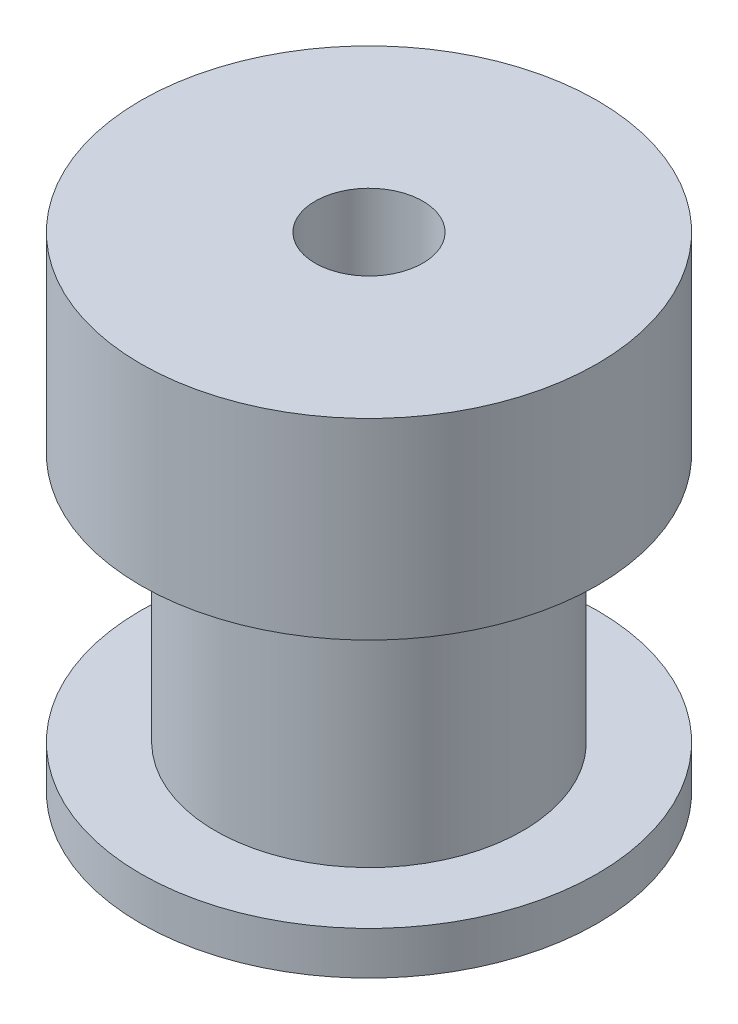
ISO-10303-21;
HEADER;
FILE_DESCRIPTION(('STEP AP214'),'2;1');
FILE_NAME('part.step','',(''),(''),'','','');
FILE_SCHEMA(('AUTOMOTIVE_DESIGN { 1 0 10303 214 1 1 1 1 }'));
ENDSEC;
DATA;
#1=APPLICATION_CONTEXT('core data for automotive mechanical design processes');
#2=APPLICATION_PROTOCOL_DEFINITION('international standard','automotive_design',2000,#1);
#3=PRODUCT_CONTEXT('',#1,'mechanical');
#4=PRODUCT('Part','Part','',(#3));
#5=PRODUCT_RELATED_PRODUCT_CATEGORY('part','',(#4));
#6=PRODUCT_DEFINITION_FORMATION('','',#4);
#7=PRODUCT_DEFINITION_CONTEXT('part definition',#1,'design');
#8=PRODUCT_DEFINITION('design','',#6,#7);
#9=PRODUCT_DEFINITION_SHAPE('','',#8);
#10=(LENGTH_UNIT() NAMED_UNIT(*) SI_UNIT(.MILLI.,.METRE.));
#11=(NAMED_UNIT(*) PLANE_ANGLE_UNIT() SI_UNIT($,.RADIAN.));
#12=(NAMED_UNIT(*) SI_UNIT($,.STERADIAN.) SOLID_ANGLE_UNIT());
#13=UNCERTAINTY_MEASURE_WITH_UNIT(LENGTH_MEASURE(1.E-05),#10,'distance_accuracy_value','');
#14=(GEOMETRIC_REPRESENTATION_CONTEXT(3) GLOBAL_UNCERTAINTY_ASSIGNED_CONTEXT((#13)) GLOBAL_UNIT_ASSIGNED_CONTEXT((#10,
#11,#12)) REPRESENTATION_CONTEXT('',''));
#15=CARTESIAN_POINT('',(0.,0.,0.));
#16=DIRECTION('',(0.,0.,1.));
#17=DIRECTION('',(1.,0.,0.));
#18=AXIS2_PLACEMENT_3D('',#15,#16,#17);
#19=CARTESIAN_POINT('',(0.,14.3002,0.));
#20=DIRECTION('',(0.,-1.,0.));
#21=DIRECTION('',(0.,0.,-1.));
#22=AXIS2_PLACEMENT_3D('',#19,#20,#21);
#23=CYLINDRICAL_SURFACE('',#22,6.731);
#24=CARTESIAN_POINT('',(0.,14.3002,0.));
#25=DIRECTION('',(0.,1.,0.));
#26=DIRECTION('',(0.,0.,1.));
#27=AXIS2_PLACEMENT_3D('',#24,#25,#26);
#28=CIRCLE('',#27,6.731);
#29=CARTESIAN_POINT('',(0.,14.3002,6.731));
#30=VERTEX_POINT('',#29);
#31=EDGE_CURVE('E10',#30,#30,#28,.T.);
#32=ORIENTED_EDGE('',*,*,#31,.F.);
#33=EDGE_LOOP('',(#32));
#34=FACE_BOUND('',#33,.T.);
#35=CARTESIAN_POINT('',(0.,8.636,0.));
#36=DIRECTION('',(0.,-1.,0.));
#37=DIRECTION('',(0.,0.,-1.));
#38=AXIS2_PLACEMENT_3D('',#35,#36,#37);
#39=CIRCLE('',#38,6.731);
#40=CARTESIAN_POINT('',(0.,8.636,-6.731));
#41=VERTEX_POINT('',#40);
#42=EDGE_CURVE('E40',#41,#41,#39,.T.);
#43=ORIENTED_EDGE('',*,*,#42,.F.);
#44=EDGE_LOOP('',(#43));
#45=FACE_BOUND('',#44,.T.);
#46=ADVANCED_FACE('F30',(#34,#45),#23,.T.);
#47=CARTESIAN_POINT('',(0.,14.3002,0.));
#48=DIRECTION('',(0.,1.,0.));
#49=DIRECTION('',(0.,0.,1.));
#50=AXIS2_PLACEMENT_3D('',#47,#48,#49);
#51=PLANE('',#50);
#52=CARTESIAN_POINT('',(0.,14.3002,0.));
#53=DIRECTION('',(0.,1.,0.));
#54=DIRECTION('',(0.,0.,1.));
#55=AXIS2_PLACEMENT_3D('',#52,#53,#54);
#56=CIRCLE('',#55,1.5875);
#57=CARTESIAN_POINT('',(0.,14.3002,1.5875));
#58=VERTEX_POINT('',#57);
#59=EDGE_CURVE('E54',#58,#58,#56,.T.);
#60=ORIENTED_EDGE('',*,*,#59,.F.);
#61=EDGE_LOOP('',(#60));
#62=FACE_BOUND('',#61,.T.);
#63=ORIENTED_EDGE('',*,*,#31,.T.);
#64=EDGE_LOOP('',(#63));
#65=FACE_BOUND('',#64,.T.);
#66=ADVANCED_FACE('F70',(#62,#65),#51,.T.);
#67=CARTESIAN_POINT('',(0.,8.636,6.731));
#68=DIRECTION('',(0.,-1.,0.));
#69=DIRECTION('',(0.,0.,-1.));
#70=AXIS2_PLACEMENT_3D('',#67,#68,#69);
#71=PLANE('',#70);
#72=ORIENTED_EDGE('',*,*,#42,.T.);
#73=EDGE_LOOP('',(#72));
#74=FACE_BOUND('',#73,.T.);
#75=CARTESIAN_POINT('',(0.,8.636,0.));
#76=DIRECTION('',(0.,-1.,0.));
#77=DIRECTION('',(0.,0.,-1.));
#78=AXIS2_PLACEMENT_3D('',#75,#76,#77);
#79=CIRCLE('',#78,4.5339);
#80=CARTESIAN_POINT('',(0.,8.636,-4.5339));
#81=VERTEX_POINT('',#80);
#82=EDGE_CURVE('E44',#81,#81,#79,.T.);
#83=ORIENTED_EDGE('',*,*,#82,.F.);
#84=EDGE_LOOP('',(#83));
#85=FACE_BOUND('',#84,.T.);
#86=ADVANCED_FACE('F72',(#74,#85),#71,.T.);
#87=CARTESIAN_POINT('',(0.,0.,0.));
#88=DIRECTION('',(0.,-1.,0.));
#89=DIRECTION('',(0.,0.,-1.));
#90=AXIS2_PLACEMENT_3D('',#87,#88,#89);
#91=CYLINDRICAL_SURFACE('',#90,4.5339);
#92=ORIENTED_EDGE('',*,*,#82,.T.);
#93=EDGE_LOOP('',(#92));
#94=FACE_BOUND('',#93,.T.);
#95=CARTESIAN_POINT('',(0.,1.27,0.));
#96=DIRECTION('',(0.,-1.,0.));
#97=DIRECTION('',(0.,0.,-1.));
#98=AXIS2_PLACEMENT_3D('',#95,#96,#97);
#99=CIRCLE('',#98,4.5339);
#100=CARTESIAN_POINT('',(0.,1.27,-4.5339));
#101=VERTEX_POINT('',#100);
#102=EDGE_CURVE('E47',#101,#101,#99,.T.);
#103=ORIENTED_EDGE('',*,*,#102,.F.);
#104=EDGE_LOOP('',(#103));
#105=FACE_BOUND('',#104,.T.);
#106=ADVANCED_FACE('F78',(#94,#105),#91,.T.);
#107=CARTESIAN_POINT('',(0.,1.27,6.731));
#108=DIRECTION('',(0.,1.,0.));
#109=DIRECTION('',(0.,0.,1.));
#110=AXIS2_PLACEMENT_3D('',#107,#108,#109);
#111=PLANE('',#110);
#112=ORIENTED_EDGE('',*,*,#102,.T.);
#113=EDGE_LOOP('',(#112));
#114=FACE_BOUND('',#113,.T.);
#115=CARTESIAN_POINT('',(0.,1.27,0.));
#116=DIRECTION('',(0.,-1.,0.));
#117=DIRECTION('',(0.,0.,-1.));
#118=AXIS2_PLACEMENT_3D('',#115,#116,#117);
#119=CIRCLE('',#118,6.731);
#120=CARTESIAN_POINT('',(0.,1.27,-6.731));
#121=VERTEX_POINT('',#120);
#122=EDGE_CURVE('E50',#121,#121,#119,.T.);
#123=ORIENTED_EDGE('',*,*,#122,.F.);
#124=EDGE_LOOP('',(#123));
#125=FACE_BOUND('',#124,.T.);
#126=ADVANCED_FACE('F84',(#114,#125),#111,.T.);
#127=CARTESIAN_POINT('',(0.,0.,0.));
#128=DIRECTION('',(0.,1.,0.));
#129=DIRECTION('',(0.,0.,1.));
#130=AXIS2_PLACEMENT_3D('',#127,#128,#129);
#131=PLANE('',#130);
#132=CARTESIAN_POINT('',(0.,0.,0.));
#133=DIRECTION('',(0.,1.,0.));
#134=DIRECTION('',(0.,0.,1.));
#135=AXIS2_PLACEMENT_3D('',#132,#133,#134);
#136=CIRCLE('',#135,1.5875);
#137=CARTESIAN_POINT('',(0.,0.,1.5875));
#138=VERTEX_POINT('',#137);
#139=EDGE_CURVE('E53',#138,#138,#136,.T.);
#140=ORIENTED_EDGE('',*,*,#139,.T.);
#141=EDGE_LOOP('',(#140));
#142=FACE_BOUND('',#141,.T.);
#143=CARTESIAN_POINT('',(0.,0.,0.));
#144=DIRECTION('',(0.,1.,0.));
#145=DIRECTION('',(0.,0.,1.));
#146=AXIS2_PLACEMENT_3D('',#143,#144,#145);
#147=CIRCLE('',#146,6.731);
#148=CARTESIAN_POINT('',(0.,0.,6.731));
#149=VERTEX_POINT('',#148);
#150=EDGE_CURVE('E33',#149,#149,#147,.T.);
#151=ORIENTED_EDGE('',*,*,#150,.F.);
#152=EDGE_LOOP('',(#151));
#153=FACE_BOUND('',#152,.T.);
#154=ADVANCED_FACE('F60',(#142,#153),#131,.F.);
#155=ORIENTED_EDGE('',*,*,#150,.T.);
#156=EDGE_LOOP('',(#155));
#157=FACE_BOUND('',#156,.T.);
#158=ORIENTED_EDGE('',*,*,#122,.T.);
#159=EDGE_LOOP('',(#158));
#160=FACE_BOUND('',#159,.T.);
#161=ADVANCED_FACE('F66',(#157,#160),#23,.T.);
#162=CARTESIAN_POINT('',(0.,0.,0.));
#163=DIRECTION('',(0.,1.,0.));
#164=DIRECTION('',(0.,0.,1.));
#165=AXIS2_PLACEMENT_3D('',#162,#163,#164);
#166=CYLINDRICAL_SURFACE('',#165,1.5875);
#167=ORIENTED_EDGE('',*,*,#139,.F.);
#168=EDGE_LOOP('',(#167));
#169=FACE_BOUND('',#168,.T.);
#170=ORIENTED_EDGE('',*,*,#59,.T.);
#171=EDGE_LOOP('',(#170));
#172=FACE_BOUND('',#171,.T.);
#173=ADVANCED_FACE('F63',(#169,#172),#166,.F.);
#174=CLOSED_SHELL('',(#46,#66,#86,#106,#126,#154,#161,#173));
#175=MANIFOLD_SOLID_BREP('B2',#174);
#176=ADVANCED_BREP_SHAPE_REPRESENTATION('',(#18,#175),#14);
#177=SHAPE_DEFINITION_REPRESENTATION(#9,#176);
ENDSEC;
END-ISO-10303-21;
